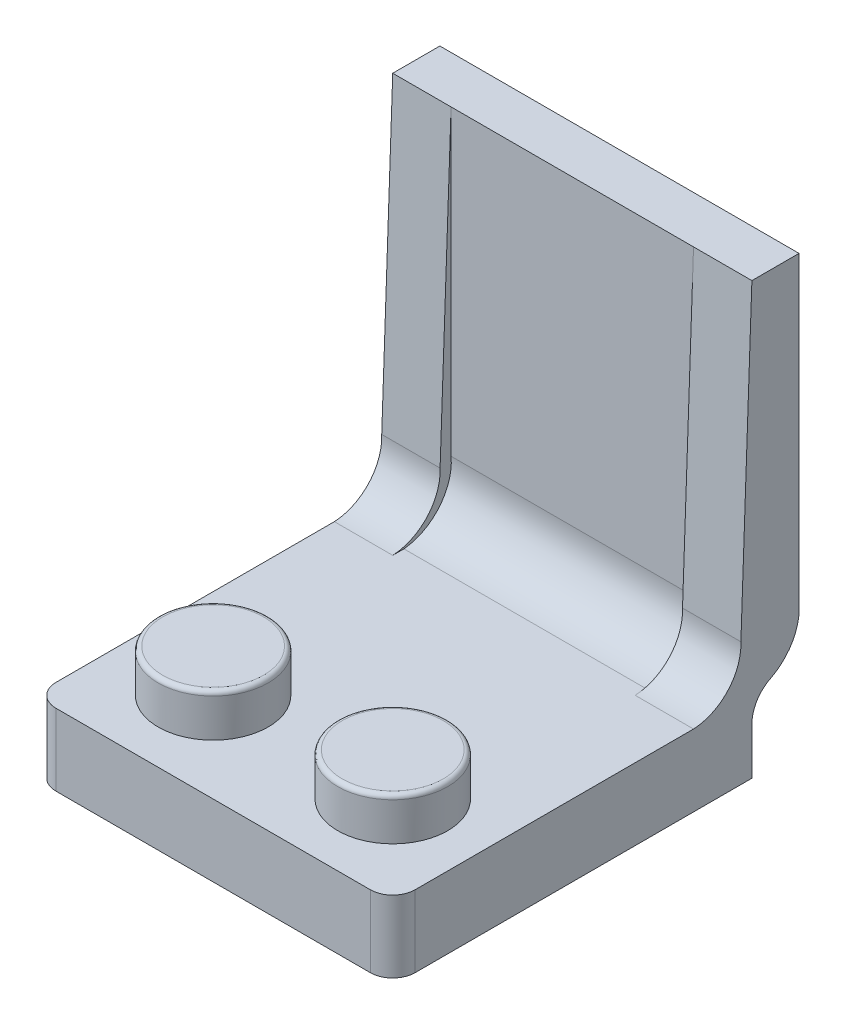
ISO-10303-21;
HEADER;
FILE_DESCRIPTION(('STEP AP214'),'2;1');
FILE_NAME('part.step','',(''),(''),'','','');
FILE_SCHEMA(('AUTOMOTIVE_DESIGN { 1 0 10303 214 1 1 1 1 }'));
ENDSEC;
DATA;
#1=APPLICATION_CONTEXT('core data for automotive mechanical design processes');
#2=APPLICATION_PROTOCOL_DEFINITION('international standard','automotive_design',2000,#1);
#3=PRODUCT_CONTEXT('',#1,'mechanical');
#4=PRODUCT('Part','Part','',(#3));
#5=PRODUCT_RELATED_PRODUCT_CATEGORY('part','',(#4));
#6=PRODUCT_DEFINITION_FORMATION('','',#4);
#7=PRODUCT_DEFINITION_CONTEXT('part definition',#1,'design');
#8=PRODUCT_DEFINITION('design','',#6,#7);
#9=PRODUCT_DEFINITION_SHAPE('','',#8);
#10=(LENGTH_UNIT() NAMED_UNIT(*) SI_UNIT(.MILLI.,.METRE.));
#11=(NAMED_UNIT(*) PLANE_ANGLE_UNIT() SI_UNIT($,.RADIAN.));
#12=(NAMED_UNIT(*) SI_UNIT($,.STERADIAN.) SOLID_ANGLE_UNIT());
#13=UNCERTAINTY_MEASURE_WITH_UNIT(LENGTH_MEASURE(1.E-05),#10,'distance_accuracy_value','');
#14=(GEOMETRIC_REPRESENTATION_CONTEXT(3) GLOBAL_UNCERTAINTY_ASSIGNED_CONTEXT((#13)) GLOBAL_UNIT_ASSIGNED_CONTEXT((#10,
#11,#12)) REPRESENTATION_CONTEXT('',''));
#15=CARTESIAN_POINT('',(0.,0.,0.));
#16=DIRECTION('',(0.,0.,1.));
#17=DIRECTION('',(1.,0.,0.));
#18=AXIS2_PLACEMENT_3D('',#15,#16,#17);
#19=CARTESIAN_POINT('',(0.,5.51162764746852,-13.6883723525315));
#20=DIRECTION('',(1.,0.,0.));
#21=DIRECTION('',(0.,0.,-1.));
#22=AXIS2_PLACEMENT_3D('',#19,#20,#21);
#23=CYLINDRICAL_SURFACE('',#22,2.32129460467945);
#24=CARTESIAN_POINT('',(2.59999999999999,5.51162764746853,-13.6883723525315));
#25=DIRECTION('',(-1.,0.,0.));
#26=DIRECTION('',(0.,0.,-1.));
#27=AXIS2_PLACEMENT_3D('',#24,#25,#26);
#28=CIRCLE('',#27,2.32129460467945);
#29=CARTESIAN_POINT('',(2.59999999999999,5.72325529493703,-16.));
#30=VERTEX_POINT('',#29);
#31=CARTESIAN_POINT('',(2.59999999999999,3.2,-13.9));
#32=VERTEX_POINT('',#31);
#33=EDGE_CURVE('E410',#30,#32,#28,.T.);
#34=ORIENTED_EDGE('',*,*,#33,.T.);
#35=DIRECTION('',(1.,0.,0.));
#36=VECTOR('',#35,1.);
#37=CARTESIAN_POINT('',(0.,3.2,-13.9));
#38=LINE('',#37,#36);
#39=CARTESIAN_POINT('',(13.4,3.2,-13.9));
#40=VERTEX_POINT('',#39);
#41=EDGE_CURVE('E326',#32,#40,#38,.T.);
#42=ORIENTED_EDGE('',*,*,#41,.T.);
#43=CARTESIAN_POINT('',(13.4,5.51162764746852,-13.6883723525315));
#44=DIRECTION('',(-1.,0.,0.));
#45=DIRECTION('',(0.,0.,1.));
#46=AXIS2_PLACEMENT_3D('',#43,#44,#45);
#47=CIRCLE('',#46,2.32129460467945);
#48=CARTESIAN_POINT('',(13.4,5.51162764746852,-16.0096669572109));
#49=VERTEX_POINT('',#48);
#50=EDGE_CURVE('E252',#49,#40,#47,.T.);
#51=ORIENTED_EDGE('',*,*,#50,.F.);
#52=DIRECTION('',(0.,0.999999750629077,0.000706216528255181));
#53=VECTOR('',#52,1.);
#54=CARTESIAN_POINT('',(13.4,5.51162764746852,-16.0096669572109));
#55=LINE('',#54,#53);
#56=CARTESIAN_POINT('',(13.4,5.51326698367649,-16.0096657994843));
#57=VERTEX_POINT('',#56);
#58=EDGE_CURVE('E268',#49,#57,#55,.T.);
#59=ORIENTED_EDGE('',*,*,#58,.T.);
#60=CARTESIAN_POINT('',(13.4,5.72325529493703,-16.));
#61=VERTEX_POINT('',#60);
#62=EDGE_CURVE('E255',#61,#57,#47,.T.);
#63=ORIENTED_EDGE('',*,*,#62,.F.);
#64=DIRECTION('',(1.,0.,0.));
#65=VECTOR('',#64,1.);
#66=CARTESIAN_POINT('',(0.,5.72325529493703,-16.));
#67=LINE('',#66,#65);
#68=EDGE_CURVE('E315',#30,#61,#67,.T.);
#69=ORIENTED_EDGE('',*,*,#68,.F.);
#70=EDGE_LOOP('',(#34,#42,#51,#59,#63,#69));
#71=FACE_BOUND('',#70,.T.);
#72=ADVANCED_FACE('F27',(#71),#23,.F.);
#73=CARTESIAN_POINT('',(0.,3.2,-16.));
#74=DIRECTION('',(0.,-1.,0.));
#75=DIRECTION('',(0.,0.,-1.));
#76=AXIS2_PLACEMENT_3D('',#73,#74,#75);
#77=PLANE('',#76);
#78=CARTESIAN_POINT('',(12.,3.2,-4.));
#79=DIRECTION('',(0.,-1.,0.));
#80=DIRECTION('',(0.,0.,-1.));
#81=AXIS2_PLACEMENT_3D('',#78,#79,#80);
#82=CIRCLE('',#81,2.45);
#83=CARTESIAN_POINT('',(12.,3.2,-6.45));
#84=VERTEX_POINT('',#83);
#85=EDGE_CURVE('E234',#84,#84,#82,.F.);
#86=ORIENTED_EDGE('',*,*,#85,.F.);
#87=EDGE_LOOP('',(#86));
#88=FACE_BOUND('',#87,.T.);
#89=DIRECTION('',(0.,0.,1.));
#90=VECTOR('',#89,1.);
#91=CARTESIAN_POINT('',(2.59999999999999,3.2,-13.9));
#92=LINE('',#91,#90);
#93=CARTESIAN_POINT('',(2.59999999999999,3.2,-13.4));
#94=VERTEX_POINT('',#93);
#95=EDGE_CURVE('E192',#32,#94,#92,.T.);
#96=ORIENTED_EDGE('',*,*,#95,.T.);
#97=DIRECTION('',(-1.,0.,0.));
#98=VECTOR('',#97,1.);
#99=CARTESIAN_POINT('',(2.59999999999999,3.2,-13.4));
#100=LINE('',#99,#98);
#101=CARTESIAN_POINT('',(0.,3.2,-13.4));
#102=VERTEX_POINT('',#101);
#103=EDGE_CURVE('E177',#94,#102,#100,.T.);
#104=ORIENTED_EDGE('',*,*,#103,.T.);
#105=DIRECTION('',(0.,0.,1.));
#106=VECTOR('',#105,1.);
#107=CARTESIAN_POINT('',(0.,3.2,0.));
#108=LINE('',#107,#106);
#109=CARTESIAN_POINT('',(0.,3.2,-1.));
#110=VERTEX_POINT('',#109);
#111=EDGE_CURVE('E189',#102,#110,#108,.T.);
#112=ORIENTED_EDGE('',*,*,#111,.T.);
#113=CARTESIAN_POINT('',(1.,3.2,-1.));
#114=DIRECTION('',(0.,-1.,0.));
#115=DIRECTION('',(0.,0.,-1.));
#116=AXIS2_PLACEMENT_3D('',#113,#114,#115);
#117=CIRCLE('',#116,1.);
#118=CARTESIAN_POINT('',(1.,3.2,0.));
#119=VERTEX_POINT('',#118);
#120=EDGE_CURVE('E232',#110,#119,#117,.F.);
#121=ORIENTED_EDGE('',*,*,#120,.T.);
#122=DIRECTION('',(1.,0.,0.));
#123=VECTOR('',#122,1.);
#124=CARTESIAN_POINT('',(0.,3.2,0.));
#125=LINE('',#124,#123);
#126=CARTESIAN_POINT('',(15.,3.2,0.));
#127=VERTEX_POINT('',#126);
#128=EDGE_CURVE('E199',#119,#127,#125,.T.);
#129=ORIENTED_EDGE('',*,*,#128,.T.);
#130=CARTESIAN_POINT('',(15.,3.2,-1.));
#131=DIRECTION('',(0.,-1.,0.));
#132=DIRECTION('',(0.,0.,-1.));
#133=AXIS2_PLACEMENT_3D('',#130,#131,#132);
#134=CIRCLE('',#133,1.);
#135=CARTESIAN_POINT('',(16.,3.2,-1.));
#136=VERTEX_POINT('',#135);
#137=EDGE_CURVE('E224',#127,#136,#134,.F.);
#138=ORIENTED_EDGE('',*,*,#137,.T.);
#139=DIRECTION('',(0.,0.,-1.));
#140=VECTOR('',#139,1.);
#141=CARTESIAN_POINT('',(16.,3.2,0.));
#142=LINE('',#141,#140);
#143=CARTESIAN_POINT('',(16.,3.2,-13.4));
#144=VERTEX_POINT('',#143);
#145=EDGE_CURVE('E202',#136,#144,#142,.T.);
#146=ORIENTED_EDGE('',*,*,#145,.T.);
#147=DIRECTION('',(1.,0.,0.));
#148=VECTOR('',#147,1.);
#149=CARTESIAN_POINT('',(13.4,3.2,-13.4));
#150=LINE('',#149,#148);
#151=CARTESIAN_POINT('',(13.4,3.2,-13.4));
#152=VERTEX_POINT('',#151);
#153=EDGE_CURVE('E292',#152,#144,#150,.T.);
#154=ORIENTED_EDGE('',*,*,#153,.F.);
#155=DIRECTION('',(0.,0.,-1.));
#156=VECTOR('',#155,1.);
#157=CARTESIAN_POINT('',(13.4,3.2,-13.4));
#158=LINE('',#157,#156);
#159=EDGE_CURVE('E288',#152,#40,#158,.T.);
#160=ORIENTED_EDGE('',*,*,#159,.T.);
#161=ORIENTED_EDGE('',*,*,#41,.F.);
#162=EDGE_LOOP('',(#96,#104,#112,#121,#129,#138,#146,#154,#160,#161));
#163=FACE_BOUND('',#162,.T.);
#164=CARTESIAN_POINT('',(4.,3.2,-4.));
#165=DIRECTION('',(0.,-1.,0.));
#166=DIRECTION('',(0.,0.,-1.));
#167=AXIS2_PLACEMENT_3D('',#164,#165,#166);
#168=CIRCLE('',#167,2.45);
#169=CARTESIAN_POINT('',(4.,3.2,-6.45));
#170=VERTEX_POINT('',#169);
#171=EDGE_CURVE('E237',#170,#170,#168,.F.);
#172=ORIENTED_EDGE('',*,*,#171,.F.);
#173=EDGE_LOOP('',(#172));
#174=FACE_BOUND('',#173,.T.);
#175=ADVANCED_FACE('F187',(#88,#163,#174),#77,.F.);
#176=CARTESIAN_POINT('',(0.,3.2,0.));
#177=DIRECTION('',(1.,0.,0.));
#178=DIRECTION('',(0.,0.,-1.));
#179=AXIS2_PLACEMENT_3D('',#176,#177,#178);
#180=PLANE('',#179);
#181=ORIENTED_EDGE('',*,*,#111,.F.);
#182=CARTESIAN_POINT('',(0.,5.41064730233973,-13.2990196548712));
#183=DIRECTION('',(1.,0.,0.));
#184=DIRECTION('',(0.,0.,1.));
#185=AXIS2_PLACEMENT_3D('',#182,#183,#184);
#186=CIRCLE('',#185,2.2129524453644);
#187=CARTESIAN_POINT('',(0.,5.51162764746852,-15.5096669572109));
#188=VERTEX_POINT('',#187);
#189=EDGE_CURVE('E173',#102,#188,#186,.T.);
#190=ORIENTED_EDGE('',*,*,#189,.T.);
#191=DIRECTION('',(0.,0.999359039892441,-0.0357981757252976));
#192=VECTOR('',#191,1.);
#193=CARTESIAN_POINT('',(0.,19.2,-16.));
#194=LINE('',#193,#192);
#195=CARTESIAN_POINT('',(0.,19.2,-16.));
#196=VERTEX_POINT('',#195);
#197=EDGE_CURVE('E183',#188,#196,#194,.T.);
#198=ORIENTED_EDGE('',*,*,#197,.T.);
#199=DIRECTION('',(0.,0.,1.));
#200=VECTOR('',#199,1.);
#201=CARTESIAN_POINT('',(0.,19.2,-16.));
#202=LINE('',#201,#200);
#203=CARTESIAN_POINT('',(0.,19.2,-18.1));
#204=VERTEX_POINT('',#203);
#205=EDGE_CURVE('E312',#204,#196,#202,.T.);
#206=ORIENTED_EDGE('',*,*,#205,.F.);
#207=DIRECTION('',(0.,1.,0.));
#208=VECTOR('',#207,1.);
#209=CARTESIAN_POINT('',(0.,19.2,-18.1));
#210=LINE('',#209,#208);
#211=CARTESIAN_POINT('',(0.,5.72325529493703,-18.1));
#212=VERTEX_POINT('',#211);
#213=EDGE_CURVE('E309',#212,#204,#210,.T.);
#214=ORIENTED_EDGE('',*,*,#213,.F.);
#215=CARTESIAN_POINT('',(0.,5.51162764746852,-15.7883723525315));
#216=DIRECTION('',(1.,0.,0.));
#217=DIRECTION('',(0.,0.,-1.));
#218=AXIS2_PLACEMENT_3D('',#215,#216,#217);
#219=CIRCLE('',#218,2.32129460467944);
#220=CARTESIAN_POINT('',(0.,3.436217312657,-16.8281226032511));
#221=VERTEX_POINT('',#220);
#222=EDGE_CURVE('E307',#221,#212,#219,.T.);
#223=ORIENTED_EDGE('',*,*,#222,.F.);
#224=CARTESIAN_POINT('',(0.,2.09510554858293,-17.5));
#225=DIRECTION('',(1.,0.,0.));
#226=DIRECTION('',(0.,0.,-1.));
#227=AXIS2_PLACEMENT_3D('',#224,#225,#226);
#228=CIRCLE('',#227,1.5);
#229=CARTESIAN_POINT('',(0.,2.09510554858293,-16.));
#230=VERTEX_POINT('',#229);
#231=EDGE_CURVE('E35',#221,#230,#228,.T.);
#232=ORIENTED_EDGE('',*,*,#231,.T.);
#233=DIRECTION('',(0.,-1.,0.));
#234=VECTOR('',#233,1.);
#235=CARTESIAN_POINT('',(0.,3.2,-16.));
#236=LINE('',#235,#234);
#237=CARTESIAN_POINT('',(0.,0.,-16.));
#238=VERTEX_POINT('',#237);
#239=EDGE_CURVE('E211',#230,#238,#236,.T.);
#240=ORIENTED_EDGE('',*,*,#239,.T.);
#241=DIRECTION('',(0.,0.,1.));
#242=VECTOR('',#241,1.);
#243=CARTESIAN_POINT('',(0.,0.,0.));
#244=LINE('',#243,#242);
#245=CARTESIAN_POINT('',(0.,0.,-1.));
#246=VERTEX_POINT('',#245);
#247=EDGE_CURVE('E366',#238,#246,#244,.T.);
#248=ORIENTED_EDGE('',*,*,#247,.T.);
#249=DIRECTION('',(0.,-1.,0.));
#250=VECTOR('',#249,1.);
#251=CARTESIAN_POINT('',(0.,3.2,-1.));
#252=LINE('',#251,#250);
#253=EDGE_CURVE('E197',#246,#110,#252,.F.);
#254=ORIENTED_EDGE('',*,*,#253,.T.);
#255=EDGE_LOOP('',(#181,#190,#198,#206,#214,#223,#232,#240,#248,#254));
#256=FACE_BOUND('',#255,.T.);
#257=ADVANCED_FACE('F29',(#256),#180,.F.);
#258=CARTESIAN_POINT('',(0.,3.2,0.));
#259=DIRECTION('',(0.,0.,-1.));
#260=DIRECTION('',(-1.,0.,0.));
#261=AXIS2_PLACEMENT_3D('',#258,#259,#260);
#262=PLANE('',#261);
#263=ORIENTED_EDGE('',*,*,#128,.F.);
#264=DIRECTION('',(0.,-1.,0.));
#265=VECTOR('',#264,1.);
#266=CARTESIAN_POINT('',(1.,3.2,0.));
#267=LINE('',#266,#265);
#268=CARTESIAN_POINT('',(1.,0.,0.));
#269=VERTEX_POINT('',#268);
#270=EDGE_CURVE('E226',#119,#269,#267,.T.);
#271=ORIENTED_EDGE('',*,*,#270,.T.);
#272=DIRECTION('',(1.,0.,0.));
#273=VECTOR('',#272,1.);
#274=CARTESIAN_POINT('',(0.,0.,0.));
#275=LINE('',#274,#273);
#276=CARTESIAN_POINT('',(15.,0.,0.));
#277=VERTEX_POINT('',#276);
#278=EDGE_CURVE('E374',#269,#277,#275,.T.);
#279=ORIENTED_EDGE('',*,*,#278,.T.);
#280=DIRECTION('',(0.,-1.,0.));
#281=VECTOR('',#280,1.);
#282=CARTESIAN_POINT('',(15.,3.2,0.));
#283=LINE('',#282,#281);
#284=EDGE_CURVE('E221',#277,#127,#283,.F.);
#285=ORIENTED_EDGE('',*,*,#284,.T.);
#286=EDGE_LOOP('',(#263,#271,#279,#285));
#287=FACE_BOUND('',#286,.T.);
#288=ADVANCED_FACE('F526',(#287),#262,.F.);
#289=CARTESIAN_POINT('',(16.,3.2,0.));
#290=DIRECTION('',(-1.,0.,0.));
#291=DIRECTION('',(0.,0.,1.));
#292=AXIS2_PLACEMENT_3D('',#289,#290,#291);
#293=PLANE('',#292);
#294=DIRECTION('',(0.,0.,1.));
#295=VECTOR('',#294,1.);
#296=CARTESIAN_POINT('',(16.,19.2,-16.));
#297=LINE('',#296,#295);
#298=CARTESIAN_POINT('',(16.,19.2,-18.1));
#299=VERTEX_POINT('',#298);
#300=CARTESIAN_POINT('',(16.,19.2,-16.));
#301=VERTEX_POINT('',#300);
#302=EDGE_CURVE('E304',#299,#301,#297,.T.);
#303=ORIENTED_EDGE('',*,*,#302,.T.);
#304=DIRECTION('',(0.,-0.999359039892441,0.0357981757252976));
#305=VECTOR('',#304,1.);
#306=CARTESIAN_POINT('',(16.,19.2,-16.));
#307=LINE('',#306,#305);
#308=CARTESIAN_POINT('',(16.,5.51162764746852,-15.5096669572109));
#309=VERTEX_POINT('',#308);
#310=EDGE_CURVE('E282',#301,#309,#307,.T.);
#311=ORIENTED_EDGE('',*,*,#310,.T.);
#312=CARTESIAN_POINT('',(16.,5.41064730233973,-13.2990196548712));
#313=DIRECTION('',(-1.,0.,0.));
#314=DIRECTION('',(0.,0.,1.));
#315=AXIS2_PLACEMENT_3D('',#312,#313,#314);
#316=CIRCLE('',#315,2.2129524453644);
#317=EDGE_CURVE('E276',#309,#144,#316,.T.);
#318=ORIENTED_EDGE('',*,*,#317,.T.);
#319=ORIENTED_EDGE('',*,*,#145,.F.);
#320=DIRECTION('',(0.,-1.,0.));
#321=VECTOR('',#320,1.);
#322=CARTESIAN_POINT('',(16.,3.2,-1.));
#323=LINE('',#322,#321);
#324=CARTESIAN_POINT('',(16.,0.,-1.));
#325=VERTEX_POINT('',#324);
#326=EDGE_CURVE('E215',#136,#325,#323,.T.);
#327=ORIENTED_EDGE('',*,*,#326,.T.);
#328=DIRECTION('',(0.,0.,-1.));
#329=VECTOR('',#328,1.);
#330=CARTESIAN_POINT('',(16.,0.,0.));
#331=LINE('',#330,#329);
#332=CARTESIAN_POINT('',(16.,0.,-16.));
#333=VERTEX_POINT('',#332);
#334=EDGE_CURVE('E205',#325,#333,#331,.T.);
#335=ORIENTED_EDGE('',*,*,#334,.T.);
#336=DIRECTION('',(0.,-1.,0.));
#337=VECTOR('',#336,1.);
#338=CARTESIAN_POINT('',(16.,3.2,-16.));
#339=LINE('',#338,#337);
#340=CARTESIAN_POINT('',(16.,2.09510554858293,-16.));
#341=VERTEX_POINT('',#340);
#342=EDGE_CURVE('E213',#341,#333,#339,.T.);
#343=ORIENTED_EDGE('',*,*,#342,.F.);
#344=CARTESIAN_POINT('',(16.,2.09510554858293,-17.5));
#345=DIRECTION('',(-1.,0.,0.));
#346=DIRECTION('',(0.,0.,1.));
#347=AXIS2_PLACEMENT_3D('',#344,#345,#346);
#348=CIRCLE('',#347,1.5);
#349=CARTESIAN_POINT('',(16.,3.436217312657,-16.8281226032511));
#350=VERTEX_POINT('',#349);
#351=EDGE_CURVE('E11',#341,#350,#348,.T.);
#352=ORIENTED_EDGE('',*,*,#351,.T.);
#353=CARTESIAN_POINT('',(16.,5.51162764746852,-15.7883723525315));
#354=DIRECTION('',(1.,0.,0.));
#355=DIRECTION('',(0.,0.,-1.));
#356=AXIS2_PLACEMENT_3D('',#353,#354,#355);
#357=CIRCLE('',#356,2.32129460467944);
#358=CARTESIAN_POINT('',(16.,5.72325529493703,-18.1));
#359=VERTEX_POINT('',#358);
#360=EDGE_CURVE('E299',#350,#359,#357,.T.);
#361=ORIENTED_EDGE('',*,*,#360,.T.);
#362=DIRECTION('',(0.,1.,0.));
#363=VECTOR('',#362,1.);
#364=CARTESIAN_POINT('',(16.,19.2,-18.1));
#365=LINE('',#364,#363);
#366=EDGE_CURVE('E301',#359,#299,#365,.T.);
#367=ORIENTED_EDGE('',*,*,#366,.T.);
#368=EDGE_LOOP('',(#303,#311,#318,#319,#327,#335,#343,#352,#361,#367));
#369=FACE_BOUND('',#368,.T.);
#370=ADVANCED_FACE('F379',(#369),#293,.F.);
#371=CARTESIAN_POINT('',(0.,3.2,-16.));
#372=DIRECTION('',(0.,0.,1.));
#373=DIRECTION('',(1.,0.,0.));
#374=AXIS2_PLACEMENT_3D('',#371,#372,#373);
#375=PLANE('',#374);
#376=ORIENTED_EDGE('',*,*,#239,.F.);
#377=DIRECTION('',(1.,0.,0.));
#378=VECTOR('',#377,1.);
#379=CARTESIAN_POINT('',(0.,2.09510554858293,-16.));
#380=LINE('',#379,#378);
#381=EDGE_CURVE('E42',#230,#341,#380,.T.);
#382=ORIENTED_EDGE('',*,*,#381,.T.);
#383=ORIENTED_EDGE('',*,*,#342,.T.);
#384=DIRECTION('',(-1.,0.,0.));
#385=VECTOR('',#384,1.);
#386=CARTESIAN_POINT('',(0.,0.,-16.));
#387=LINE('',#386,#385);
#388=EDGE_CURVE('E200',#333,#238,#387,.T.);
#389=ORIENTED_EDGE('',*,*,#388,.T.);
#390=EDGE_LOOP('',(#376,#382,#383,#389));
#391=FACE_BOUND('',#390,.T.);
#392=ADVANCED_FACE('F387',(#391),#375,.F.);
#393=CARTESIAN_POINT('',(0.,0.,-16.));
#394=DIRECTION('',(0.,-1.,0.));
#395=DIRECTION('',(0.,0.,-1.));
#396=AXIS2_PLACEMENT_3D('',#393,#394,#395);
#397=PLANE('',#396);
#398=DIRECTION('',(0.,0.,-1.));
#399=VECTOR('',#398,1.);
#400=CARTESIAN_POINT('',(1.59999999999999,0.,-1.6));
#401=LINE('',#400,#399);
#402=CARTESIAN_POINT('',(1.59999999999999,0.,-1.6));
#403=VERTEX_POINT('',#402);
#404=CARTESIAN_POINT('',(1.59999999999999,0.,-14.4));
#405=VERTEX_POINT('',#404);
#406=EDGE_CURVE('E340',#403,#405,#401,.T.);
#407=ORIENTED_EDGE('',*,*,#406,.F.);
#408=DIRECTION('',(-1.,0.,0.));
#409=VECTOR('',#408,1.);
#410=CARTESIAN_POINT('',(1.59999999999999,0.,-1.6));
#411=LINE('',#410,#409);
#412=CARTESIAN_POINT('',(14.4,0.,-1.6));
#413=VERTEX_POINT('',#412);
#414=EDGE_CURVE('E348',#413,#403,#411,.T.);
#415=ORIENTED_EDGE('',*,*,#414,.F.);
#416=DIRECTION('',(0.,0.,1.));
#417=VECTOR('',#416,1.);
#418=CARTESIAN_POINT('',(14.4,0.,-1.6));
#419=LINE('',#418,#417);
#420=CARTESIAN_POINT('',(14.4,0.,-14.4));
#421=VERTEX_POINT('',#420);
#422=EDGE_CURVE('E345',#421,#413,#419,.T.);
#423=ORIENTED_EDGE('',*,*,#422,.F.);
#424=DIRECTION('',(1.,0.,0.));
#425=VECTOR('',#424,1.);
#426=CARTESIAN_POINT('',(1.59999999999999,0.,-14.4));
#427=LINE('',#426,#425);
#428=EDGE_CURVE('E342',#405,#421,#427,.T.);
#429=ORIENTED_EDGE('',*,*,#428,.F.);
#430=EDGE_LOOP('',(#407,#415,#423,#429));
#431=FACE_BOUND('',#430,.T.);
#432=ORIENTED_EDGE('',*,*,#278,.F.);
#433=CARTESIAN_POINT('',(1.,0.,-1.));
#434=DIRECTION('',(0.,-1.,0.));
#435=DIRECTION('',(0.,0.,-1.));
#436=AXIS2_PLACEMENT_3D('',#433,#434,#435);
#437=CIRCLE('',#436,1.);
#438=EDGE_CURVE('E229',#269,#246,#437,.T.);
#439=ORIENTED_EDGE('',*,*,#438,.T.);
#440=ORIENTED_EDGE('',*,*,#247,.F.);
#441=ORIENTED_EDGE('',*,*,#388,.F.);
#442=ORIENTED_EDGE('',*,*,#334,.F.);
#443=CARTESIAN_POINT('',(15.,0.,-1.));
#444=DIRECTION('',(0.,-1.,0.));
#445=DIRECTION('',(0.,0.,-1.));
#446=AXIS2_PLACEMENT_3D('',#443,#444,#445);
#447=CIRCLE('',#446,1.);
#448=EDGE_CURVE('E218',#325,#277,#447,.T.);
#449=ORIENTED_EDGE('',*,*,#448,.T.);
#450=EDGE_LOOP('',(#432,#439,#440,#441,#442,#449));
#451=FACE_BOUND('',#450,.T.);
#452=ADVANCED_FACE('F386',(#431,#451),#397,.T.);
#453=CARTESIAN_POINT('',(15.,3.2,-1.));
#454=DIRECTION('',(0.,-1.,0.));
#455=DIRECTION('',(0.,0.,-1.));
#456=AXIS2_PLACEMENT_3D('',#453,#454,#455);
#457=CYLINDRICAL_SURFACE('',#456,1.);
#458=ORIENTED_EDGE('',*,*,#137,.F.);
#459=ORIENTED_EDGE('',*,*,#284,.F.);
#460=ORIENTED_EDGE('',*,*,#448,.F.);
#461=ORIENTED_EDGE('',*,*,#326,.F.);
#462=EDGE_LOOP('',(#458,#459,#460,#461));
#463=FACE_BOUND('',#462,.T.);
#464=ADVANCED_FACE('F515',(#463),#457,.T.);
#465=CARTESIAN_POINT('',(1.,3.2,-1.));
#466=DIRECTION('',(0.,-1.,0.));
#467=DIRECTION('',(0.,0.,-1.));
#468=AXIS2_PLACEMENT_3D('',#465,#466,#467);
#469=CYLINDRICAL_SURFACE('',#468,1.);
#470=ORIENTED_EDGE('',*,*,#120,.F.);
#471=ORIENTED_EDGE('',*,*,#253,.F.);
#472=ORIENTED_EDGE('',*,*,#438,.F.);
#473=ORIENTED_EDGE('',*,*,#270,.F.);
#474=EDGE_LOOP('',(#470,#471,#472,#473));
#475=FACE_BOUND('',#474,.T.);
#476=ADVANCED_FACE('F511',(#475),#469,.T.);
#477=CARTESIAN_POINT('',(12.,5.1,-4.));
#478=DIRECTION('',(0.,-1.,0.));
#479=DIRECTION('',(0.,0.,-1.));
#480=AXIS2_PLACEMENT_3D('',#477,#478,#479);
#481=CYLINDRICAL_SURFACE('',#480,2.45);
#482=CARTESIAN_POINT('',(12.,4.9,-4.));
#483=DIRECTION('',(0.,1.,0.));
#484=DIRECTION('',(0.,0.,1.));
#485=AXIS2_PLACEMENT_3D('',#482,#483,#484);
#486=CIRCLE('',#485,2.45);
#487=CARTESIAN_POINT('',(12.,4.9,-6.45));
#488=VERTEX_POINT('',#487);
#489=EDGE_CURVE('E249',#488,#488,#486,.F.);
#490=CARTESIAN_POINT('',(12.,4.9,-6.45));
#491=CARTESIAN_POINT('',(12.,4.88229166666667,-6.45));
#492=CARTESIAN_POINT('',(12.,4.86458333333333,-6.45));
#493=CARTESIAN_POINT('',(12.,4.82916666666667,-6.45));
#494=CARTESIAN_POINT('',(12.,4.81145833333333,-6.45));
#495=CARTESIAN_POINT('',(12.,4.77604166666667,-6.45));
#496=CARTESIAN_POINT('',(12.,4.75833333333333,-6.45));
#497=CARTESIAN_POINT('',(12.,4.72291666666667,-6.45));
#498=CARTESIAN_POINT('',(12.,4.70520833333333,-6.45));
#499=CARTESIAN_POINT('',(12.,4.66979166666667,-6.45));
#500=CARTESIAN_POINT('',(12.,4.65208333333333,-6.45));
#501=CARTESIAN_POINT('',(12.,4.61666666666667,-6.45));
#502=CARTESIAN_POINT('',(12.,4.59895833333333,-6.45));
#503=CARTESIAN_POINT('',(12.,4.56354166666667,-6.45));
#504=CARTESIAN_POINT('',(12.,4.54583333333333,-6.45));
#505=CARTESIAN_POINT('',(12.,4.51041666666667,-6.45));
#506=CARTESIAN_POINT('',(12.,4.49270833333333,-6.45));
#507=CARTESIAN_POINT('',(12.,4.45729166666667,-6.45));
#508=CARTESIAN_POINT('',(12.,4.43958333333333,-6.45));
#509=CARTESIAN_POINT('',(12.,4.40416666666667,-6.45));
#510=CARTESIAN_POINT('',(12.,4.38645833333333,-6.45));
#511=CARTESIAN_POINT('',(12.,4.35104166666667,-6.45));
#512=CARTESIAN_POINT('',(12.,4.33333333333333,-6.45));
#513=CARTESIAN_POINT('',(12.,4.29791666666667,-6.45));
#514=CARTESIAN_POINT('',(12.,4.28020833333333,-6.45));
#515=CARTESIAN_POINT('',(12.,4.24479166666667,-6.45));
#516=CARTESIAN_POINT('',(12.,4.22708333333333,-6.45));
#517=CARTESIAN_POINT('',(12.,4.19166666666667,-6.45));
#518=CARTESIAN_POINT('',(12.,4.17395833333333,-6.45));
#519=CARTESIAN_POINT('',(12.,4.13854166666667,-6.45));
#520=CARTESIAN_POINT('',(12.,4.12083333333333,-6.45));
#521=CARTESIAN_POINT('',(12.,4.08541666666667,-6.45));
#522=CARTESIAN_POINT('',(12.,4.06770833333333,-6.45));
#523=CARTESIAN_POINT('',(12.,4.03229166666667,-6.45));
#524=CARTESIAN_POINT('',(12.,4.01458333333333,-6.45));
#525=CARTESIAN_POINT('',(12.,3.97916666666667,-6.45));
#526=CARTESIAN_POINT('',(12.,3.96145833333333,-6.45));
#527=CARTESIAN_POINT('',(12.,3.92604166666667,-6.45));
#528=CARTESIAN_POINT('',(12.,3.90833333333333,-6.45));
#529=CARTESIAN_POINT('',(12.,3.87291666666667,-6.45));
#530=CARTESIAN_POINT('',(12.,3.85520833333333,-6.45));
#531=CARTESIAN_POINT('',(12.,3.81979166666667,-6.45));
#532=CARTESIAN_POINT('',(12.,3.80208333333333,-6.45));
#533=CARTESIAN_POINT('',(12.,3.76666666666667,-6.45));
#534=CARTESIAN_POINT('',(12.,3.74895833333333,-6.45));
#535=CARTESIAN_POINT('',(12.,3.71354166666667,-6.45));
#536=CARTESIAN_POINT('',(12.,3.69583333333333,-6.45));
#537=CARTESIAN_POINT('',(12.,3.66041666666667,-6.45));
#538=CARTESIAN_POINT('',(12.,3.64270833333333,-6.45));
#539=CARTESIAN_POINT('',(12.,3.60729166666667,-6.45));
#540=CARTESIAN_POINT('',(12.,3.58958333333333,-6.45));
#541=CARTESIAN_POINT('',(12.,3.55416666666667,-6.45));
#542=CARTESIAN_POINT('',(12.,3.53645833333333,-6.45));
#543=CARTESIAN_POINT('',(12.,3.50104166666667,-6.45));
#544=CARTESIAN_POINT('',(12.,3.48333333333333,-6.45));
#545=CARTESIAN_POINT('',(12.,3.44791666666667,-6.45));
#546=CARTESIAN_POINT('',(12.,3.43020833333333,-6.45));
#547=CARTESIAN_POINT('',(12.,3.39479166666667,-6.45));
#548=CARTESIAN_POINT('',(12.,3.37708333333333,-6.45));
#549=CARTESIAN_POINT('',(12.,3.34166666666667,-6.45));
#550=CARTESIAN_POINT('',(12.,3.32395833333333,-6.45));
#551=CARTESIAN_POINT('',(12.,3.28854166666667,-6.45));
#552=CARTESIAN_POINT('',(12.,3.27083333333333,-6.45));
#553=CARTESIAN_POINT('',(12.,3.23541666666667,-6.45));
#554=CARTESIAN_POINT('',(12.,3.21770833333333,-6.45));
#555=CARTESIAN_POINT('',(12.,3.2,-6.45));
#556=B_SPLINE_CURVE_WITH_KNOTS('',3,(#490,#491,#492,#493,#494,#495,#496,#497,#498,#499,#500,
#501,#502,#503,#504,#505,#506,#507,#508,#509,#510,#511,#512,#513,#514,#515,#516,#517,#518,#519,
#520,#521,#522,#523,#524,#525,#526,#527,#528,#529,#530,#531,#532,#533,#534,#535,#536,#537,#538,
#539,#540,#541,#542,#543,#544,#545,#546,#547,#548,#549,#550,#551,#552,#553,#554,#555),
.UNSPECIFIED.,.F.,.F.,(4,2,2,2,2,2,2,2,2,2,2,2,2,2,2,2,2,2,2,2,2,2,2,2,2,2,2,2,2,2,2,2,4),(0.,
0.0531250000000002,0.10625,0.159375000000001,0.2125,0.265625,0.31875,0.371875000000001,0.425,
0.478125,0.53125,0.584375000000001,0.6375,0.690625,0.74375,0.796875,0.85,0.903125,0.95625,
1.009375,1.0625,1.115625,1.16875,1.221875,1.275,1.328125,1.38125,1.434375,1.4875,1.540625,
1.59375,1.646875,1.7),.UNSPECIFIED.);
#557=EDGE_CURVE('BSEAM507',#488,#84,#556,.T.);
#558=ORIENTED_EDGE('',*,*,#489,.T.);
#559=ORIENTED_EDGE('',*,*,#85,.T.);
#560=ORIENTED_EDGE('',*,*,#557,.T.);
#561=ORIENTED_EDGE('',*,*,#557,.F.);
#562=EDGE_LOOP('',(#558,#560,#559,#561));
#563=FACE_BOUND('',#562,.T.);
#564=ADVANCED_FACE('F507',(#563),#481,.T.);
#565=CARTESIAN_POINT('',(12.,5.1,-4.));
#566=DIRECTION('',(0.,1.,0.));
#567=DIRECTION('',(0.,0.,1.));
#568=AXIS2_PLACEMENT_3D('',#565,#566,#567);
#569=PLANE('',#568);
#570=CARTESIAN_POINT('',(12.,5.1,-4.));
#571=DIRECTION('',(0.,1.,0.));
#572=DIRECTION('',(0.,0.,1.));
#573=AXIS2_PLACEMENT_3D('',#570,#571,#572);
#574=CIRCLE('',#573,2.25);
#575=CARTESIAN_POINT('',(12.,5.1,-1.75));
#576=VERTEX_POINT('',#575);
#577=EDGE_CURVE('E246',#576,#576,#574,.T.);
#578=ORIENTED_EDGE('',*,*,#577,.T.);
#579=EDGE_LOOP('',(#578));
#580=FACE_BOUND('',#579,.T.);
#581=ADVANCED_FACE('F503',(#580),#569,.T.);
#582=CARTESIAN_POINT('',(4.,5.1,-4.));
#583=DIRECTION('',(0.,-1.,0.));
#584=DIRECTION('',(0.,0.,-1.));
#585=AXIS2_PLACEMENT_3D('',#582,#583,#584);
#586=CYLINDRICAL_SURFACE('',#585,2.45);
#587=CARTESIAN_POINT('',(4.,4.9,-4.));
#588=DIRECTION('',(0.,1.,0.));
#589=DIRECTION('',(0.,0.,1.));
#590=AXIS2_PLACEMENT_3D('',#587,#588,#589);
#591=CIRCLE('',#590,2.45);
#592=CARTESIAN_POINT('',(4.,4.9,-6.45));
#593=VERTEX_POINT('',#592);
#594=EDGE_CURVE('E243',#593,#593,#591,.F.);
#595=CARTESIAN_POINT('',(4.,4.9,-6.45));
#596=CARTESIAN_POINT('',(4.,4.88229166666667,-6.45));
#597=CARTESIAN_POINT('',(4.,4.86458333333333,-6.45));
#598=CARTESIAN_POINT('',(4.,4.82916666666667,-6.45));
#599=CARTESIAN_POINT('',(4.,4.81145833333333,-6.45));
#600=CARTESIAN_POINT('',(4.,4.77604166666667,-6.45));
#601=CARTESIAN_POINT('',(4.,4.75833333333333,-6.45));
#602=CARTESIAN_POINT('',(4.,4.72291666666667,-6.45));
#603=CARTESIAN_POINT('',(4.,4.70520833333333,-6.45));
#604=CARTESIAN_POINT('',(4.,4.66979166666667,-6.45));
#605=CARTESIAN_POINT('',(4.,4.65208333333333,-6.45));
#606=CARTESIAN_POINT('',(4.,4.61666666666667,-6.45));
#607=CARTESIAN_POINT('',(4.,4.59895833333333,-6.45));
#608=CARTESIAN_POINT('',(4.,4.56354166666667,-6.45));
#609=CARTESIAN_POINT('',(4.,4.54583333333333,-6.45));
#610=CARTESIAN_POINT('',(4.,4.51041666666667,-6.45));
#611=CARTESIAN_POINT('',(4.,4.49270833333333,-6.45));
#612=CARTESIAN_POINT('',(4.,4.45729166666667,-6.45));
#613=CARTESIAN_POINT('',(4.,4.43958333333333,-6.45));
#614=CARTESIAN_POINT('',(4.,4.40416666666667,-6.45));
#615=CARTESIAN_POINT('',(4.,4.38645833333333,-6.45));
#616=CARTESIAN_POINT('',(4.,4.35104166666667,-6.45));
#617=CARTESIAN_POINT('',(4.,4.33333333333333,-6.45));
#618=CARTESIAN_POINT('',(4.,4.29791666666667,-6.45));
#619=CARTESIAN_POINT('',(4.,4.28020833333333,-6.45));
#620=CARTESIAN_POINT('',(4.,4.24479166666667,-6.45));
#621=CARTESIAN_POINT('',(4.,4.22708333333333,-6.45));
#622=CARTESIAN_POINT('',(4.,4.19166666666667,-6.45));
#623=CARTESIAN_POINT('',(4.,4.17395833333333,-6.45));
#624=CARTESIAN_POINT('',(4.,4.13854166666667,-6.45));
#625=CARTESIAN_POINT('',(4.,4.12083333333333,-6.45));
#626=CARTESIAN_POINT('',(4.,4.08541666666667,-6.45));
#627=CARTESIAN_POINT('',(4.,4.06770833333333,-6.45));
#628=CARTESIAN_POINT('',(4.,4.03229166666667,-6.45));
#629=CARTESIAN_POINT('',(4.,4.01458333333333,-6.45));
#630=CARTESIAN_POINT('',(4.,3.97916666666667,-6.45));
#631=CARTESIAN_POINT('',(4.,3.96145833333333,-6.45));
#632=CARTESIAN_POINT('',(4.,3.92604166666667,-6.45));
#633=CARTESIAN_POINT('',(4.,3.90833333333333,-6.45));
#634=CARTESIAN_POINT('',(4.,3.87291666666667,-6.45));
#635=CARTESIAN_POINT('',(4.,3.85520833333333,-6.45));
#636=CARTESIAN_POINT('',(4.,3.81979166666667,-6.45));
#637=CARTESIAN_POINT('',(4.,3.80208333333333,-6.45));
#638=CARTESIAN_POINT('',(4.,3.76666666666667,-6.45));
#639=CARTESIAN_POINT('',(4.,3.74895833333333,-6.45));
#640=CARTESIAN_POINT('',(4.,3.71354166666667,-6.45));
#641=CARTESIAN_POINT('',(4.,3.69583333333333,-6.45));
#642=CARTESIAN_POINT('',(4.,3.66041666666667,-6.45));
#643=CARTESIAN_POINT('',(4.,3.64270833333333,-6.45));
#644=CARTESIAN_POINT('',(4.,3.60729166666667,-6.45));
#645=CARTESIAN_POINT('',(4.,3.58958333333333,-6.45));
#646=CARTESIAN_POINT('',(4.,3.55416666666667,-6.45));
#647=CARTESIAN_POINT('',(4.,3.53645833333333,-6.45));
#648=CARTESIAN_POINT('',(4.,3.50104166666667,-6.45));
#649=CARTESIAN_POINT('',(4.,3.48333333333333,-6.45));
#650=CARTESIAN_POINT('',(4.,3.44791666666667,-6.45));
#651=CARTESIAN_POINT('',(4.,3.43020833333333,-6.45));
#652=CARTESIAN_POINT('',(4.,3.39479166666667,-6.45));
#653=CARTESIAN_POINT('',(4.,3.37708333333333,-6.45));
#654=CARTESIAN_POINT('',(4.,3.34166666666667,-6.45));
#655=CARTESIAN_POINT('',(4.,3.32395833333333,-6.45));
#656=CARTESIAN_POINT('',(4.,3.28854166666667,-6.45));
#657=CARTESIAN_POINT('',(4.,3.27083333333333,-6.45));
#658=CARTESIAN_POINT('',(4.,3.23541666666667,-6.45));
#659=CARTESIAN_POINT('',(4.,3.21770833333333,-6.45));
#660=CARTESIAN_POINT('',(4.,3.2,-6.45));
#661=B_SPLINE_CURVE_WITH_KNOTS('',3,(#595,#596,#597,#598,#599,#600,#601,#602,#603,#604,#605,
#606,#607,#608,#609,#610,#611,#612,#613,#614,#615,#616,#617,#618,#619,#620,#621,#622,#623,#624,
#625,#626,#627,#628,#629,#630,#631,#632,#633,#634,#635,#636,#637,#638,#639,#640,#641,#642,#643,
#644,#645,#646,#647,#648,#649,#650,#651,#652,#653,#654,#655,#656,#657,#658,#659,#660),
.UNSPECIFIED.,.F.,.F.,(4,2,2,2,2,2,2,2,2,2,2,2,2,2,2,2,2,2,2,2,2,2,2,2,2,2,2,2,2,2,2,2,4),(0.,
0.0531250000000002,0.10625,0.159375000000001,0.2125,0.265625,0.31875,0.371875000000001,0.425,
0.478125,0.53125,0.584375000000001,0.6375,0.690625,0.74375,0.796875,0.85,0.903125,0.95625,
1.009375,1.0625,1.115625,1.16875,1.221875,1.275,1.328125,1.38125,1.434375,1.4875,1.540625,
1.59375,1.646875,1.7),.UNSPECIFIED.);
#662=EDGE_CURVE('BSEAM499',#593,#170,#661,.T.);
#663=ORIENTED_EDGE('',*,*,#594,.T.);
#664=ORIENTED_EDGE('',*,*,#171,.T.);
#665=ORIENTED_EDGE('',*,*,#662,.T.);
#666=ORIENTED_EDGE('',*,*,#662,.F.);
#667=EDGE_LOOP('',(#663,#665,#664,#666));
#668=FACE_BOUND('',#667,.T.);
#669=ADVANCED_FACE('F499',(#668),#586,.T.);
#670=CARTESIAN_POINT('',(4.,5.1,-4.));
#671=DIRECTION('',(0.,1.,0.));
#672=DIRECTION('',(0.,0.,1.));
#673=AXIS2_PLACEMENT_3D('',#670,#671,#672);
#674=PLANE('',#673);
#675=CARTESIAN_POINT('',(4.,5.1,-4.));
#676=DIRECTION('',(0.,1.,0.));
#677=DIRECTION('',(0.,0.,1.));
#678=AXIS2_PLACEMENT_3D('',#675,#676,#677);
#679=CIRCLE('',#678,2.25);
#680=CARTESIAN_POINT('',(4.,5.1,-1.75));
#681=VERTEX_POINT('',#680);
#682=EDGE_CURVE('E240',#681,#681,#679,.T.);
#683=ORIENTED_EDGE('',*,*,#682,.T.);
#684=EDGE_LOOP('',(#683));
#685=FACE_BOUND('',#684,.T.);
#686=ADVANCED_FACE('F495',(#685),#674,.T.);
#687=CARTESIAN_POINT('',(4.,4.9,-4.));
#688=DIRECTION('',(0.,1.,0.));
#689=DIRECTION('',(0.,0.,1.));
#690=AXIS2_PLACEMENT_3D('',#687,#688,#689);
#691=TOROIDAL_SURFACE('',#690,2.25,0.2);
#692=ORIENTED_EDGE('',*,*,#594,.F.);
#693=EDGE_LOOP('',(#692));
#694=FACE_BOUND('',#693,.T.);
#695=ORIENTED_EDGE('',*,*,#682,.F.);
#696=EDGE_LOOP('',(#695));
#697=FACE_BOUND('',#696,.T.);
#698=ADVANCED_FACE('F491',(#694,#697),#691,.T.);
#699=CARTESIAN_POINT('',(12.,4.9,-4.));
#700=DIRECTION('',(0.,1.,0.));
#701=DIRECTION('',(0.,0.,1.));
#702=AXIS2_PLACEMENT_3D('',#699,#700,#701);
#703=TOROIDAL_SURFACE('',#702,2.25,0.2);
#704=ORIENTED_EDGE('',*,*,#489,.F.);
#705=EDGE_LOOP('',(#704));
#706=FACE_BOUND('',#705,.T.);
#707=ORIENTED_EDGE('',*,*,#577,.F.);
#708=EDGE_LOOP('',(#707));
#709=FACE_BOUND('',#708,.T.);
#710=ADVANCED_FACE('F487',(#706,#709),#703,.T.);
#711=CARTESIAN_POINT('',(1.59999999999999,2.1,-1.6));
#712=DIRECTION('',(-1.,0.,0.));
#713=DIRECTION('',(0.,0.,1.));
#714=AXIS2_PLACEMENT_3D('',#711,#712,#713);
#715=PLANE('',#714);
#716=ORIENTED_EDGE('',*,*,#406,.T.);
#717=DIRECTION('',(0.,-1.,0.));
#718=VECTOR('',#717,1.);
#719=CARTESIAN_POINT('',(1.59999999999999,2.1,-14.4));
#720=LINE('',#719,#718);
#721=CARTESIAN_POINT('',(1.59999999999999,2.1,-14.4));
#722=VERTEX_POINT('',#721);
#723=EDGE_CURVE('E363',#722,#405,#720,.T.);
#724=ORIENTED_EDGE('',*,*,#723,.F.);
#725=DIRECTION('',(0.,0.,-1.));
#726=VECTOR('',#725,1.);
#727=CARTESIAN_POINT('',(1.59999999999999,2.1,-1.6));
#728=LINE('',#727,#726);
#729=CARTESIAN_POINT('',(1.59999999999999,2.1,-1.6));
#730=VERTEX_POINT('',#729);
#731=EDGE_CURVE('E351',#730,#722,#728,.T.);
#732=ORIENTED_EDGE('',*,*,#731,.F.);
#733=DIRECTION('',(0.,-1.,0.));
#734=VECTOR('',#733,1.);
#735=CARTESIAN_POINT('',(1.59999999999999,2.1,-1.6));
#736=LINE('',#735,#734);
#737=EDGE_CURVE('E364',#730,#403,#736,.T.);
#738=ORIENTED_EDGE('',*,*,#737,.T.);
#739=EDGE_LOOP('',(#716,#724,#732,#738));
#740=FACE_BOUND('',#739,.T.);
#741=ADVANCED_FACE('F477',(#740),#715,.F.);
#742=CARTESIAN_POINT('',(1.59999999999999,2.1,-1.6));
#743=DIRECTION('',(0.,0.,1.));
#744=DIRECTION('',(1.,0.,0.));
#745=AXIS2_PLACEMENT_3D('',#742,#743,#744);
#746=PLANE('',#745);
#747=ORIENTED_EDGE('',*,*,#414,.T.);
#748=ORIENTED_EDGE('',*,*,#737,.F.);
#749=DIRECTION('',(-1.,0.,0.));
#750=VECTOR('',#749,1.);
#751=CARTESIAN_POINT('',(1.59999999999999,2.1,-1.6));
#752=LINE('',#751,#750);
#753=CARTESIAN_POINT('',(14.4,2.1,-1.6));
#754=VERTEX_POINT('',#753);
#755=EDGE_CURVE('E360',#754,#730,#752,.T.);
#756=ORIENTED_EDGE('',*,*,#755,.F.);
#757=DIRECTION('',(0.,-1.,0.));
#758=VECTOR('',#757,1.);
#759=CARTESIAN_POINT('',(14.4,2.1,-1.6));
#760=LINE('',#759,#758);
#761=EDGE_CURVE('E367',#754,#413,#760,.T.);
#762=ORIENTED_EDGE('',*,*,#761,.T.);
#763=EDGE_LOOP('',(#747,#748,#756,#762));
#764=FACE_BOUND('',#763,.T.);
#765=ADVANCED_FACE('F473',(#764),#746,.F.);
#766=CARTESIAN_POINT('',(14.4,2.1,-1.6));
#767=DIRECTION('',(1.,0.,0.));
#768=DIRECTION('',(0.,0.,-1.));
#769=AXIS2_PLACEMENT_3D('',#766,#767,#768);
#770=PLANE('',#769);
#771=ORIENTED_EDGE('',*,*,#422,.T.);
#772=ORIENTED_EDGE('',*,*,#761,.F.);
#773=DIRECTION('',(0.,0.,1.));
#774=VECTOR('',#773,1.);
#775=CARTESIAN_POINT('',(14.4,2.1,-1.6));
#776=LINE('',#775,#774);
#777=CARTESIAN_POINT('',(14.4,2.1,-14.4));
#778=VERTEX_POINT('',#777);
#779=EDGE_CURVE('E357',#778,#754,#776,.T.);
#780=ORIENTED_EDGE('',*,*,#779,.F.);
#781=DIRECTION('',(0.,-1.,0.));
#782=VECTOR('',#781,1.);
#783=CARTESIAN_POINT('',(14.4,2.1,-14.4));
#784=LINE('',#783,#782);
#785=EDGE_CURVE('E369',#778,#421,#784,.T.);
#786=ORIENTED_EDGE('',*,*,#785,.T.);
#787=EDGE_LOOP('',(#771,#772,#780,#786));
#788=FACE_BOUND('',#787,.T.);
#789=ADVANCED_FACE('F476',(#788),#770,.F.);
#790=CARTESIAN_POINT('',(1.59999999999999,2.1,-14.4));
#791=DIRECTION('',(0.,0.,-1.));
#792=DIRECTION('',(-1.,0.,0.));
#793=AXIS2_PLACEMENT_3D('',#790,#791,#792);
#794=PLANE('',#793);
#795=ORIENTED_EDGE('',*,*,#428,.T.);
#796=ORIENTED_EDGE('',*,*,#785,.F.);
#797=DIRECTION('',(1.,0.,0.));
#798=VECTOR('',#797,1.);
#799=CARTESIAN_POINT('',(1.59999999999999,2.1,-14.4));
#800=LINE('',#799,#798);
#801=EDGE_CURVE('E354',#722,#778,#800,.T.);
#802=ORIENTED_EDGE('',*,*,#801,.F.);
#803=ORIENTED_EDGE('',*,*,#723,.T.);
#804=EDGE_LOOP('',(#795,#796,#802,#803));
#805=FACE_BOUND('',#804,.T.);
#806=ADVANCED_FACE('F471',(#805),#794,.F.);
#807=CARTESIAN_POINT('',(1.59999999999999,2.1,-14.4));
#808=DIRECTION('',(0.,-1.,0.));
#809=DIRECTION('',(0.,0.,-1.));
#810=AXIS2_PLACEMENT_3D('',#807,#808,#809);
#811=PLANE('',#810);
#812=CARTESIAN_POINT('',(12.,2.1,-4.));
#813=DIRECTION('',(0.,-1.,0.));
#814=DIRECTION('',(0.,0.,-1.));
#815=AXIS2_PLACEMENT_3D('',#812,#813,#814);
#816=CIRCLE('',#815,1.6);
#817=CARTESIAN_POINT('',(12.,2.1,-5.6));
#818=VERTEX_POINT('',#817);
#819=EDGE_CURVE('E319',#818,#818,#816,.T.);
#820=ORIENTED_EDGE('',*,*,#819,.F.);
#821=EDGE_LOOP('',(#820));
#822=FACE_BOUND('',#821,.T.);
#823=CARTESIAN_POINT('',(4.,2.1,-4.));
#824=DIRECTION('',(0.,-1.,0.));
#825=DIRECTION('',(0.,0.,-1.));
#826=AXIS2_PLACEMENT_3D('',#823,#824,#825);
#827=CIRCLE('',#826,1.6);
#828=CARTESIAN_POINT('',(4.,2.1,-5.6));
#829=VERTEX_POINT('',#828);
#830=EDGE_CURVE('E334',#829,#829,#827,.T.);
#831=ORIENTED_EDGE('',*,*,#830,.F.);
#832=EDGE_LOOP('',(#831));
#833=FACE_BOUND('',#832,.T.);
#834=ORIENTED_EDGE('',*,*,#731,.T.);
#835=ORIENTED_EDGE('',*,*,#801,.T.);
#836=ORIENTED_EDGE('',*,*,#779,.T.);
#837=ORIENTED_EDGE('',*,*,#755,.T.);
#838=EDGE_LOOP('',(#834,#835,#836,#837));
#839=FACE_BOUND('',#838,.T.);
#840=ADVANCED_FACE('F467',(#822,#833,#839),#811,.T.);
#841=CARTESIAN_POINT('',(4.,4.2,-4.));
#842=DIRECTION('',(0.,-1.,0.));
#843=DIRECTION('',(0.,0.,-1.));
#844=AXIS2_PLACEMENT_3D('',#841,#842,#843);
#845=CYLINDRICAL_SURFACE('',#844,1.6);
#846=CARTESIAN_POINT('',(4.,4.2,-4.));
#847=DIRECTION('',(0.,-1.,0.));
#848=DIRECTION('',(0.,0.,-1.));
#849=AXIS2_PLACEMENT_3D('',#846,#847,#848);
#850=CIRCLE('',#849,1.6);
#851=CARTESIAN_POINT('',(4.,4.2,-5.6));
#852=VERTEX_POINT('',#851);
#853=EDGE_CURVE('E337',#852,#852,#850,.T.);
#854=ORIENTED_EDGE('',*,*,#853,.F.);
#855=EDGE_LOOP('',(#854));
#856=FACE_BOUND('',#855,.T.);
#857=ORIENTED_EDGE('',*,*,#830,.T.);
#858=EDGE_LOOP('',(#857));
#859=FACE_BOUND('',#858,.T.);
#860=ADVANCED_FACE('F463',(#856,#859),#845,.F.);
#861=CARTESIAN_POINT('',(4.,4.2,-4.));
#862=DIRECTION('',(0.,-1.,0.));
#863=DIRECTION('',(0.,0.,-1.));
#864=AXIS2_PLACEMENT_3D('',#861,#862,#863);
#865=PLANE('',#864);
#866=ORIENTED_EDGE('',*,*,#853,.T.);
#867=EDGE_LOOP('',(#866));
#868=FACE_BOUND('',#867,.T.);
#869=ADVANCED_FACE('F459',(#868),#865,.T.);
#870=CARTESIAN_POINT('',(12.,4.2,-4.));
#871=DIRECTION('',(0.,-1.,0.));
#872=DIRECTION('',(0.,0.,-1.));
#873=AXIS2_PLACEMENT_3D('',#870,#871,#872);
#874=CYLINDRICAL_SURFACE('',#873,1.6);
#875=CARTESIAN_POINT('',(12.,4.2,-4.));
#876=DIRECTION('',(0.,-1.,0.));
#877=DIRECTION('',(0.,0.,-1.));
#878=AXIS2_PLACEMENT_3D('',#875,#876,#877);
#879=CIRCLE('',#878,1.6);
#880=CARTESIAN_POINT('',(12.,4.2,-5.6));
#881=VERTEX_POINT('',#880);
#882=EDGE_CURVE('E331',#881,#881,#879,.T.);
#883=ORIENTED_EDGE('',*,*,#882,.F.);
#884=EDGE_LOOP('',(#883));
#885=FACE_BOUND('',#884,.T.);
#886=ORIENTED_EDGE('',*,*,#819,.T.);
#887=EDGE_LOOP('',(#886));
#888=FACE_BOUND('',#887,.T.);
#889=ADVANCED_FACE('F455',(#885,#888),#874,.F.);
#890=CARTESIAN_POINT('',(12.,4.2,-4.));
#891=DIRECTION('',(0.,-1.,0.));
#892=DIRECTION('',(0.,0.,-1.));
#893=AXIS2_PLACEMENT_3D('',#890,#891,#892);
#894=PLANE('',#893);
#895=ORIENTED_EDGE('',*,*,#882,.T.);
#896=EDGE_LOOP('',(#895));
#897=FACE_BOUND('',#896,.T.);
#898=ADVANCED_FACE('F452',(#897),#894,.T.);
#899=CARTESIAN_POINT('',(0.,19.2,-16.));
#900=DIRECTION('',(0.,0.,1.));
#901=DIRECTION('',(1.,0.,0.));
#902=AXIS2_PLACEMENT_3D('',#899,#900,#901);
#903=PLANE('',#902);
#904=DIRECTION('',(0.,-1.,0.));
#905=VECTOR('',#904,1.);
#906=CARTESIAN_POINT('',(2.59999999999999,19.2,-16.));
#907=LINE('',#906,#905);
#908=CARTESIAN_POINT('',(2.59999999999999,19.2,-16.));
#909=VERTEX_POINT('',#908);
#910=EDGE_CURVE('E409',#909,#30,#907,.T.);
#911=ORIENTED_EDGE('',*,*,#910,.T.);
#912=ORIENTED_EDGE('',*,*,#68,.T.);
#913=DIRECTION('',(0.,-1.,0.));
#914=VECTOR('',#913,1.);
#915=CARTESIAN_POINT('',(13.4,19.2,-16.));
#916=LINE('',#915,#914);
#917=CARTESIAN_POINT('',(13.4,19.2,-16.));
#918=VERTEX_POINT('',#917);
#919=EDGE_CURVE('E271',#918,#61,#916,.T.);
#920=ORIENTED_EDGE('',*,*,#919,.F.);
#921=DIRECTION('',(1.,0.,0.));
#922=VECTOR('',#921,1.);
#923=CARTESIAN_POINT('',(0.,19.2,-16.));
#924=LINE('',#923,#922);
#925=EDGE_CURVE('E320',#909,#918,#924,.T.);
#926=ORIENTED_EDGE('',*,*,#925,.F.);
#927=EDGE_LOOP('',(#911,#912,#920,#926));
#928=FACE_BOUND('',#927,.T.);
#929=ADVANCED_FACE('F407',(#928),#903,.T.);
#930=CARTESIAN_POINT('',(0.,19.2,-16.));
#931=DIRECTION('',(0.,1.,0.));
#932=DIRECTION('',(0.,0.,1.));
#933=AXIS2_PLACEMENT_3D('',#930,#931,#932);
#934=PLANE('',#933);
#935=ORIENTED_EDGE('',*,*,#302,.F.);
#936=DIRECTION('',(1.,0.,0.));
#937=VECTOR('',#936,1.);
#938=CARTESIAN_POINT('',(0.,19.2,-18.1));
#939=LINE('',#938,#937);
#940=EDGE_CURVE('E321',#204,#299,#939,.T.);
#941=ORIENTED_EDGE('',*,*,#940,.F.);
#942=ORIENTED_EDGE('',*,*,#205,.T.);
#943=EDGE_CURVE('E316',#196,#909,#924,.T.);
#944=ORIENTED_EDGE('',*,*,#943,.T.);
#945=ORIENTED_EDGE('',*,*,#925,.T.);
#946=DIRECTION('',(1.,0.,0.));
#947=VECTOR('',#946,1.);
#948=CARTESIAN_POINT('',(13.4,19.2,-16.));
#949=LINE('',#948,#947);
#950=EDGE_CURVE('E291',#918,#301,#949,.T.);
#951=ORIENTED_EDGE('',*,*,#950,.T.);
#952=EDGE_LOOP('',(#935,#941,#942,#944,#945,#951));
#953=FACE_BOUND('',#952,.T.);
#954=ADVANCED_FACE('F399',(#953),#934,.T.);
#955=CARTESIAN_POINT('',(0.,19.2,-18.1));
#956=DIRECTION('',(0.,0.,-1.));
#957=DIRECTION('',(-1.,0.,0.));
#958=AXIS2_PLACEMENT_3D('',#955,#956,#957);
#959=PLANE('',#958);
#960=ORIENTED_EDGE('',*,*,#366,.F.);
#961=DIRECTION('',(1.,0.,0.));
#962=VECTOR('',#961,1.);
#963=CARTESIAN_POINT('',(0.,5.72325529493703,-18.1));
#964=LINE('',#963,#962);
#965=EDGE_CURVE('E323',#212,#359,#964,.T.);
#966=ORIENTED_EDGE('',*,*,#965,.F.);
#967=ORIENTED_EDGE('',*,*,#213,.T.);
#968=ORIENTED_EDGE('',*,*,#940,.T.);
#969=EDGE_LOOP('',(#960,#966,#967,#968));
#970=FACE_BOUND('',#969,.T.);
#971=ADVANCED_FACE('F395',(#970),#959,.T.);
#972=CARTESIAN_POINT('',(0.,5.51162764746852,-15.7883723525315));
#973=DIRECTION('',(1.,0.,0.));
#974=DIRECTION('',(0.,0.,-1.));
#975=AXIS2_PLACEMENT_3D('',#972,#973,#974);
#976=CYLINDRICAL_SURFACE('',#975,2.32129460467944);
#977=ORIENTED_EDGE('',*,*,#360,.F.);
#978=DIRECTION('',(1.,0.,0.));
#979=VECTOR('',#978,1.);
#980=CARTESIAN_POINT('',(0.,3.436217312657,-16.8281226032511));
#981=LINE('',#980,#979);
#982=EDGE_CURVE('E256',#350,#221,#981,.F.);
#983=ORIENTED_EDGE('',*,*,#982,.T.);
#984=ORIENTED_EDGE('',*,*,#222,.T.);
#985=ORIENTED_EDGE('',*,*,#965,.T.);
#986=EDGE_LOOP('',(#977,#983,#984,#985));
#987=FACE_BOUND('',#986,.T.);
#988=ADVANCED_FACE('F390',(#987),#976,.T.);
#989=CARTESIAN_POINT('',(13.4,5.41064730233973,-13.2990196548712));
#990=DIRECTION('',(1.,0.,0.));
#991=DIRECTION('',(0.,0.,-1.));
#992=AXIS2_PLACEMENT_3D('',#989,#990,#991);
#993=CYLINDRICAL_SURFACE('',#992,2.2129524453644);
#994=ORIENTED_EDGE('',*,*,#317,.F.);
#995=DIRECTION('',(1.,0.,0.));
#996=VECTOR('',#995,1.);
#997=CARTESIAN_POINT('',(13.4,5.51162764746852,-15.5096669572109));
#998=LINE('',#997,#996);
#999=CARTESIAN_POINT('',(13.4,5.51162764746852,-15.5096669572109));
#1000=VERTEX_POINT('',#999);
#1001=EDGE_CURVE('E294',#1000,#309,#998,.T.);
#1002=ORIENTED_EDGE('',*,*,#1001,.F.);
#1003=CARTESIAN_POINT('',(13.4,5.41064730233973,-13.2990196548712));
#1004=DIRECTION('',(-1.,0.,0.));
#1005=DIRECTION('',(0.,0.,1.));
#1006=AXIS2_PLACEMENT_3D('',#1003,#1004,#1005);
#1007=CIRCLE('',#1006,2.2129524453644);
#1008=EDGE_CURVE('E279',#1000,#152,#1007,.T.);
#1009=ORIENTED_EDGE('',*,*,#1008,.T.);
#1010=ORIENTED_EDGE('',*,*,#153,.T.);
#1011=EDGE_LOOP('',(#994,#1002,#1009,#1010));
#1012=FACE_BOUND('',#1011,.T.);
#1013=ADVANCED_FACE('F416',(#1012),#993,.F.);
#1014=CARTESIAN_POINT('',(13.4,19.2,-16.));
#1015=DIRECTION('',(0.,0.0357981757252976,0.999359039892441));
#1016=DIRECTION('',(0.,-0.999359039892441,0.0357981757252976));
#1017=AXIS2_PLACEMENT_3D('',#1014,#1015,#1016);
#1018=PLANE('',#1017);
#1019=ORIENTED_EDGE('',*,*,#310,.F.);
#1020=ORIENTED_EDGE('',*,*,#950,.F.);
#1021=DIRECTION('',(0.,-0.999359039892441,0.0357981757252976));
#1022=VECTOR('',#1021,1.);
#1023=CARTESIAN_POINT('',(13.4,19.2,-16.));
#1024=LINE('',#1023,#1022);
#1025=EDGE_CURVE('E275',#918,#1000,#1024,.T.);
#1026=ORIENTED_EDGE('',*,*,#1025,.T.);
#1027=ORIENTED_EDGE('',*,*,#1001,.T.);
#1028=EDGE_LOOP('',(#1019,#1020,#1026,#1027));
#1029=FACE_BOUND('',#1028,.T.);
#1030=ADVANCED_FACE('F403',(#1029),#1018,.T.);
#1031=CARTESIAN_POINT('',(13.4,5.41064730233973,-13.2990196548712));
#1032=DIRECTION('',(-1.,0.,0.));
#1033=DIRECTION('',(0.,0.,1.));
#1034=AXIS2_PLACEMENT_3D('',#1031,#1032,#1033);
#1035=PLANE('',#1034);
#1036=ORIENTED_EDGE('',*,*,#1025,.F.);
#1037=ORIENTED_EDGE('',*,*,#919,.T.);
#1038=ORIENTED_EDGE('',*,*,#62,.T.);
#1039=ORIENTED_EDGE('',*,*,#58,.F.);
#1040=ORIENTED_EDGE('',*,*,#50,.T.);
#1041=ORIENTED_EDGE('',*,*,#159,.F.);
#1042=ORIENTED_EDGE('',*,*,#1008,.F.);
#1043=EDGE_LOOP('',(#1036,#1037,#1038,#1039,#1040,#1041,#1042));
#1044=FACE_BOUND('',#1043,.T.);
#1045=ADVANCED_FACE('F267',(#1044),#1035,.T.);
#1046=CARTESIAN_POINT('',(2.59999999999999,19.2,-16.));
#1047=DIRECTION('',(0.,0.0357981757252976,0.999359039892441));
#1048=DIRECTION('',(0.,-0.999359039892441,0.0357981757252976));
#1049=AXIS2_PLACEMENT_3D('',#1046,#1047,#1048);
#1050=PLANE('',#1049);
#1051=ORIENTED_EDGE('',*,*,#197,.F.);
#1052=DIRECTION('',(-1.,0.,0.));
#1053=VECTOR('',#1052,1.);
#1054=CARTESIAN_POINT('',(2.59999999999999,5.51162764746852,-15.5096669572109));
#1055=LINE('',#1054,#1053);
#1056=CARTESIAN_POINT('',(2.59999999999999,5.51162764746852,-15.5096669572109));
#1057=VERTEX_POINT('',#1056);
#1058=EDGE_CURVE('E179',#1057,#188,#1055,.T.);
#1059=ORIENTED_EDGE('',*,*,#1058,.F.);
#1060=DIRECTION('',(0.,0.999359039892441,-0.0357981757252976));
#1061=VECTOR('',#1060,1.);
#1062=CARTESIAN_POINT('',(2.59999999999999,19.2,-16.));
#1063=LINE('',#1062,#1061);
#1064=EDGE_CURVE('E193',#1057,#909,#1063,.T.);
#1065=ORIENTED_EDGE('',*,*,#1064,.T.);
#1066=ORIENTED_EDGE('',*,*,#943,.F.);
#1067=EDGE_LOOP('',(#1051,#1059,#1065,#1066));
#1068=FACE_BOUND('',#1067,.T.);
#1069=ADVANCED_FACE('F426',(#1068),#1050,.T.);
#1070=CARTESIAN_POINT('',(2.59999999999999,5.41064730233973,-13.2990196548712));
#1071=DIRECTION('',(-1.,0.,0.));
#1072=DIRECTION('',(0.,0.,1.));
#1073=AXIS2_PLACEMENT_3D('',#1070,#1071,#1072);
#1074=CYLINDRICAL_SURFACE('',#1073,2.2129524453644);
#1075=ORIENTED_EDGE('',*,*,#189,.F.);
#1076=ORIENTED_EDGE('',*,*,#103,.F.);
#1077=CARTESIAN_POINT('',(2.59999999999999,5.41064730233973,-13.2990196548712));
#1078=DIRECTION('',(1.,0.,0.));
#1079=DIRECTION('',(0.,0.,1.));
#1080=AXIS2_PLACEMENT_3D('',#1077,#1078,#1079);
#1081=CIRCLE('',#1080,2.2129524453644);
#1082=EDGE_CURVE('E420',#94,#1057,#1081,.T.);
#1083=ORIENTED_EDGE('',*,*,#1082,.T.);
#1084=ORIENTED_EDGE('',*,*,#1058,.T.);
#1085=EDGE_LOOP('',(#1075,#1076,#1083,#1084));
#1086=FACE_BOUND('',#1085,.T.);
#1087=ADVANCED_FACE('F175',(#1086),#1074,.F.);
#1088=CARTESIAN_POINT('',(2.59999999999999,5.51162764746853,-13.6883723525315));
#1089=DIRECTION('',(1.,0.,0.));
#1090=DIRECTION('',(0.,0.,-1.));
#1091=AXIS2_PLACEMENT_3D('',#1088,#1089,#1090);
#1092=PLANE('',#1091);
#1093=ORIENTED_EDGE('',*,*,#910,.F.);
#1094=ORIENTED_EDGE('',*,*,#1064,.F.);
#1095=ORIENTED_EDGE('',*,*,#1082,.F.);
#1096=ORIENTED_EDGE('',*,*,#95,.F.);
#1097=ORIENTED_EDGE('',*,*,#33,.F.);
#1098=EDGE_LOOP('',(#1093,#1094,#1095,#1096,#1097));
#1099=FACE_BOUND('',#1098,.T.);
#1100=ADVANCED_FACE('F428',(#1099),#1092,.T.);
#1101=CARTESIAN_POINT('',(0.,2.09510554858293,-17.5));
#1102=DIRECTION('',(1.,0.,0.));
#1103=DIRECTION('',(0.,0.,-1.));
#1104=AXIS2_PLACEMENT_3D('',#1101,#1102,#1103);
#1105=CYLINDRICAL_SURFACE('',#1104,1.5);
#1106=ORIENTED_EDGE('',*,*,#351,.F.);
#1107=ORIENTED_EDGE('',*,*,#381,.F.);
#1108=ORIENTED_EDGE('',*,*,#231,.F.);
#1109=ORIENTED_EDGE('',*,*,#982,.F.);
#1110=EDGE_LOOP('',(#1106,#1107,#1108,#1109));
#1111=FACE_BOUND('',#1110,.T.);
#1112=ADVANCED_FACE('F389',(#1111),#1105,.F.);
#1113=CLOSED_SHELL('',(#72,#175,#257,#288,#370,#392,#452,#464,#476,#564,#581,#669,#686,#698,
#710,#741,#765,#789,#806,#840,#860,#869,#889,#898,#929,#954,#971,#988,#1013,#1030,#1045,#1069,
#1087,#1100,#1112));
#1114=MANIFOLD_SOLID_BREP('B2',#1113);
#1115=ADVANCED_BREP_SHAPE_REPRESENTATION('',(#18,#1114),#14);
#1116=SHAPE_DEFINITION_REPRESENTATION(#9,#1115);
ENDSEC;
END-ISO-10303-21;
